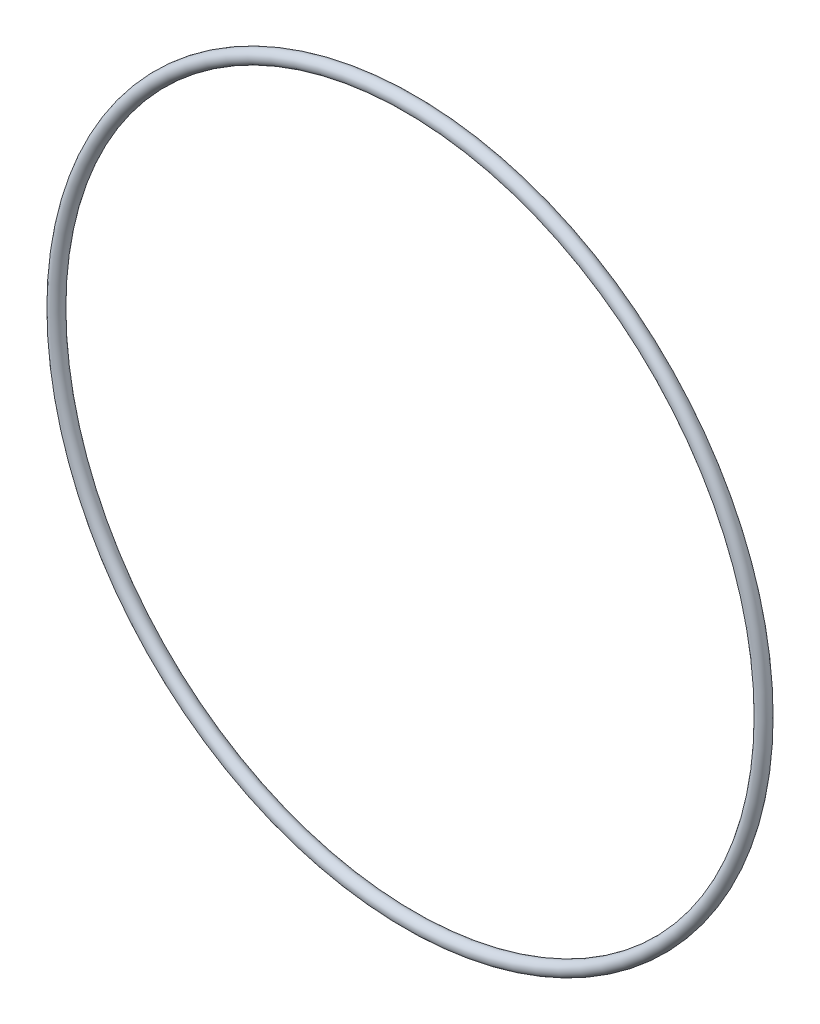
from build123d import *

# Parameters (mm, degrees)
SKETCH2_R = 1.5875


with BuildPart() as part:
    # Base-Sweep: sweep along a path in Sketch1
    with BuildLine(Plane.XY) as base_sweep_path:
        CenterArc((0, 0), 83.47075, 0, 360)
    # Sketch2 → Base-Sweep (sweep)
    with BuildSketch(Plane(origin=(0, 0, 0), x_dir=(0, 0, -1), z_dir=(1, 0, 0))):
        with Locations((0, 83.47075)):
            Circle(SKETCH2_R)
    sweep(path=base_sweep_path.line)


solid = part.part
